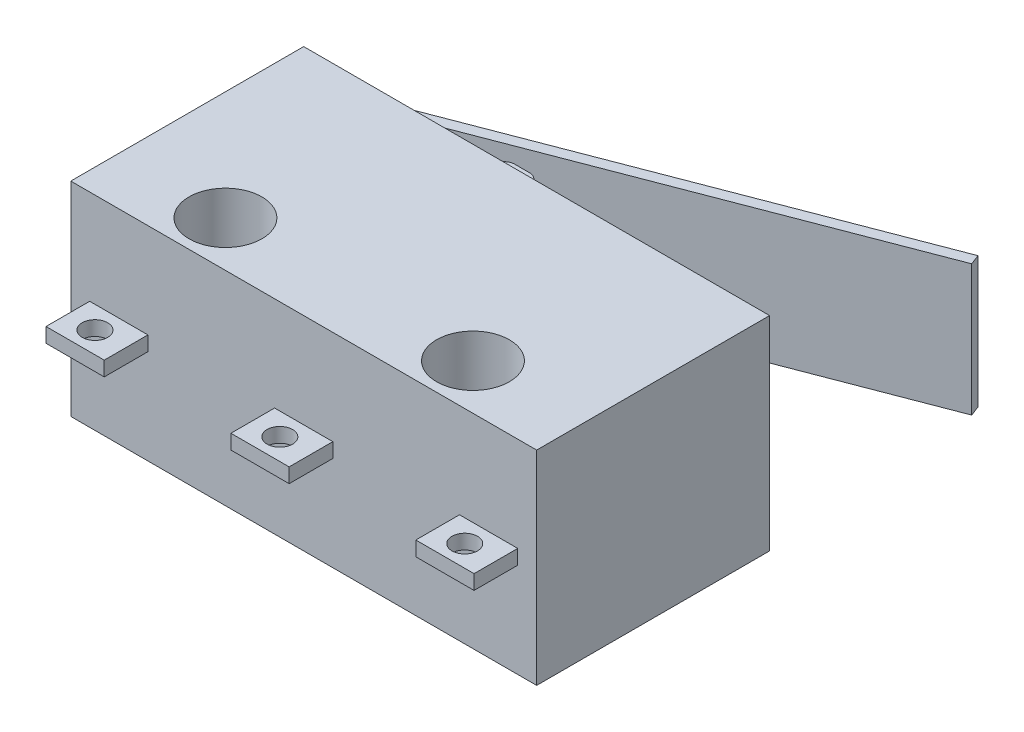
from build123d import *

# Parameters (mm, degrees)
ESQUISSE1_W             = 12.8
ESQUISSE1_H             = 6.4
ESQUISSE1_R             = 1
EXTRUSION1_DEPTH        = 5.6
ESQUISSE2_W             = 1
ESQUISSE2_H             = 2.8
EXTRUSION2_DEPTH        = 1.5
CONG_1_R                = 0.3
ESQUISSE3_W             = 0.3
ESQUISSE3_H             = 3.6
ESQUISSE6_W             = 1.6
ESQUISSE6_H             = 0.4
BOSS_EXTRU_1_DEPTH      = 1.2
ESQUISSE7_R             = 0.35
ENL_V_MAT_EXTRU_1_DEPTH = 0.5


with BuildPart() as part:
    # Esquisse1 → Extrusion1 (new body)
    with BuildSketch(Plane(origin=(0, 0, 0), x_dir=(1, 0, 0), z_dir=(0, 1, 0))):
        with Locations((6.4, 3.2)):
            Rectangle(ESQUISSE1_W, ESQUISSE1_H)
        with Locations(Location((3, 1.25, 0), (0, 0, 270))):
            Circle(ESQUISSE1_R, mode=Mode.SUBTRACT)
        with Locations(Location((9.8, 1.25, 0), (0, 0, 90))):
            Circle(ESQUISSE1_R, mode=Mode.SUBTRACT)
    extrude(amount=EXTRUSION1_DEPTH)

    # Esquisse2 → Extrusion2 (add)
    with BuildSketch(Plane(origin=(0, 0, -6.4), x_dir=(-1, 0, 0), z_dir=(0, 0, -1))):
        with Locations((-4.5, 2.8)):
            Rectangle(ESQUISSE2_W, ESQUISSE2_H)
    extrude(amount=EXTRUSION2_DEPTH)

    # Cong_1
    cong_1_edges = [part.edges().sort_by_distance(p)[0] for p in [
        (4, 2.8, -7.9),
        (5, 2.8, -7.9),
    ]]
    fillet(cong_1_edges, radius=CONG_1_R)

    # Balayage1: sweep along a path in Esquisse4
    with BuildLine(Plane(origin=(0, 2.8, 0), x_dir=(-1, 0, 0), z_dir=(0, 1, 0))) as balayage1_path:
        Line((-1.15, -6.4), (-1.15, -6.728014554))
        ThreePointArc((-1.15, -6.728014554), (-1.194032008, -6.869708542), (-1.31061749, -6.961489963))
        Line((-1.31061749, -6.961489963), (-13.290721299, -11.547890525))
    # Esquisse3 → Balayage1 (sweep)
    with BuildSketch(Plane(origin=(0, 0, -6.4), x_dir=(-1, 0, 0), z_dir=(0, 0, -1))):
        with Locations((-1.15, 2.8)):
            Rectangle(ESQUISSE3_W, ESQUISSE3_H)
    sweep(path=balayage1_path.line)

    # Esquisse6 → Boss.-Extru.1 (add)
    with BuildSketch(Plane.XY):
        with Locations((6.4, 2.8)):
            Rectangle(ESQUISSE6_W, ESQUISSE6_H)
        with Locations((1.32, 2.8)):
            Rectangle(ESQUISSE6_W, ESQUISSE6_H)
        with Locations((11.48, 2.8)):
            Rectangle(ESQUISSE6_W, ESQUISSE6_H)
    extrude(amount=BOSS_EXTRU_1_DEPTH)

    # Esquisse7 → Enl_v. mat.-Extru.1 (cut)
    with BuildSketch(Plane.XZ.offset(-2.6)):
        with Locations(Location((1.277391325, 0.61296794, 0), (0, 0, 270))):
            Circle(ESQUISSE7_R)
        with Locations(Location((6.357391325, 0.61296794, 0), (0, 0, 270))):
            Circle(ESQUISSE7_R)
        with Locations(Location((11.437391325, 0.61296794, 0), (0, 0, 270))):
            Circle(ESQUISSE7_R)
    extrude(amount=-ENL_V_MAT_EXTRU_1_DEPTH, mode=Mode.SUBTRACT)


solid = part.part
